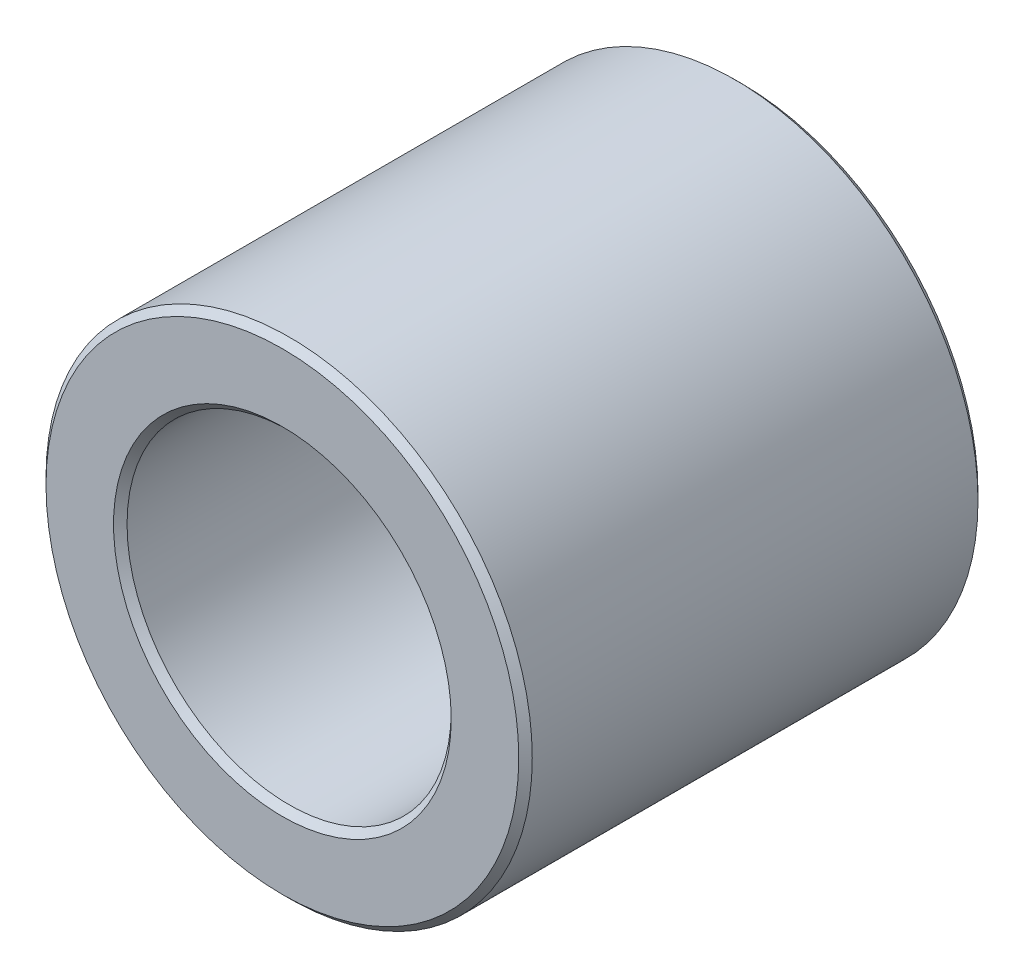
from build123d import *

# Parameters (mm, degrees)
ESQUISSE1_R      = 9
ESQUISSE1_R_2    = 6
EXTRUSION1_DEPTH = 17
CHANFREIN1_SIZE  = 0.25


with BuildPart() as part:
    # Esquisse1 → Extrusion1 (new body)
    with BuildSketch(Plane.XY):
        Circle(ESQUISSE1_R)
        Circle(ESQUISSE1_R_2, mode=Mode.SUBTRACT)
    extrude(amount=-EXTRUSION1_DEPTH)

    # Chanfrein1
    chanfrein1_edges = [part.edges().sort_by_distance(p)[0] for p in [
        (-9, 0, 0),
        (-9, 0, -17),
        (-6, 0, -17),
        (-6, 0, 0),
    ]]
    chamfer(chanfrein1_edges, length=CHANFREIN1_SIZE)


solid = part.part
